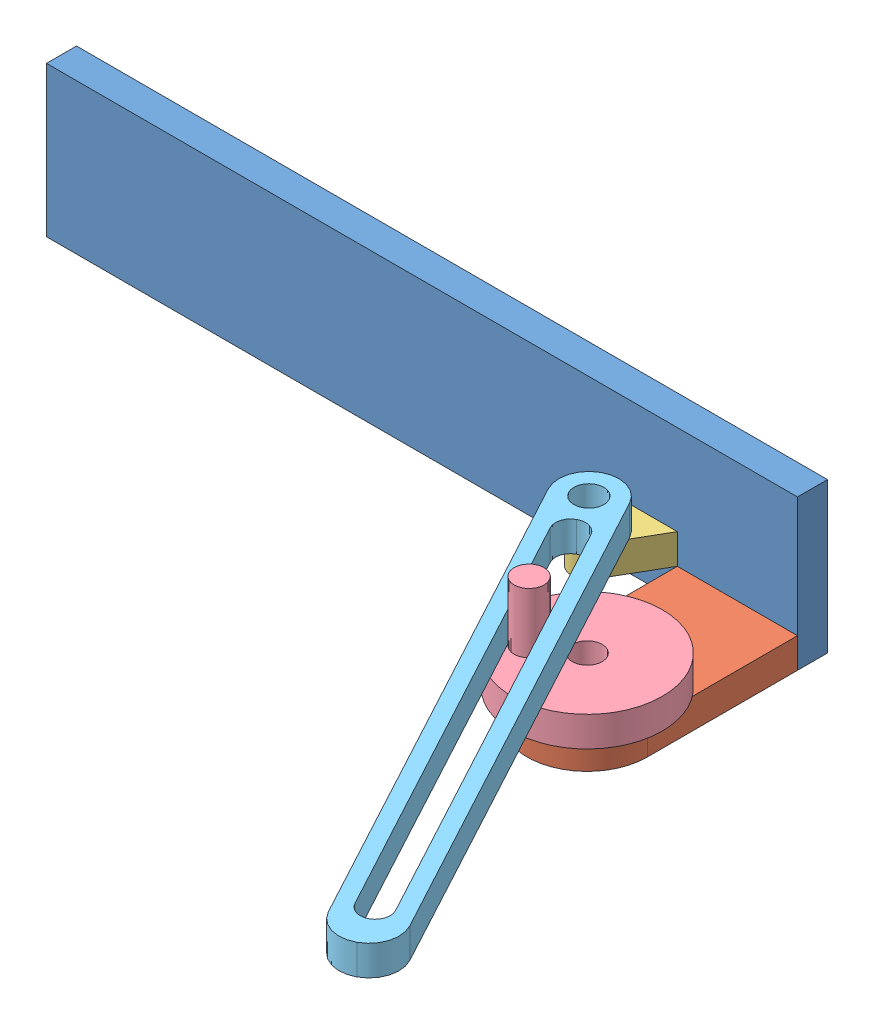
SolidWorks assembly linkage1.SLDASM, configuration Default (file format 6000). Lengths in mm.
Overall size (293.86 50 196.47).
5 component instances, 5 part files, 11 mates.
Components (placement in the parent):
- BASE-1: BASE.SLDPRT [Default] at (-20.7654 104.7281 181.6357) size (250 50 10)
- base1-1: base1.SLDPRT [Default] at (189.2346 114.7281 191.6357) x (1 0 0) z (0 -1 0) size (40 70 10)
- base2-1: base2.SLDPRT [Default] at (159.2346 124.7281 191.6357) x (1 0 0) z (0 -1 0) size (30 20.21 10)
- drive-1: drive.SLDPRT [Default] at (209.2346 114.7281 241.6357) x (-0.538478 0 -0.842639) z (0 1 0) size (50 50 30)
- slot-1: slot.SLDPRT [Default] at (178.3001 134.7281 192.5243) x (0.473984 0 0.880533) z (0 -1 0) size (200 20 10)
Mates (geometry in assembly coordinates):
- Coincident1: coincident anti-aligned: plane of BASE-1 through (-20.7654 104.7281 191.6357) normal (0 0 1); plane of base1-1 through (229.2346 104.7281 191.6357) normal (0 0 -1)
- Coincident2: coincident aligned: line of BASE-1 through (-20.7654 104.7281 191.6357) axis (1 0 0); line of base1-1 through (189.2346 104.7281 191.6357) axis (1 0 0)
- Coincident3: coincident aligned: line of BASE-1 through (229.2346 104.7281 191.6357) axis (0 1 0); line of base1-1 through (229.2346 104.7281 191.6357) axis (0 1 0)
- Coincident4: coincident anti-aligned: plane of BASE-1 through (-20.7654 104.7281 191.6357) normal (0 0 1); plane of base2-1 through (189.2346 114.7281 191.6357) normal (0 0 -1)
- Coincident5: coincident anti-aligned: plane of base1-1 through (209.2346 114.7281 241.6357) normal (0 1 0); plane of drive-1 through (209.2346 114.7281 241.6357) normal (0 -1 0)
- Concentric1: concentric anti-aligned: cylinder of base1-1 through (209.2346 114.7281 241.6357) axis (0 -1 0) radius 5; cylinder of drive-1 through (209.2346 114.7281 241.6357) axis (0 1 0) radius 5
- Coincident6: coincident anti-aligned: plane of drive-1 through (209.2346 124.7281 241.6357) normal (0 1 0); plane of slot-1 through (178.3001 124.7281 192.5243) normal (0 -1 0)
- Tangent2: tangent anti-aligned: cylinder of drive-1 through (197.4377 144.7281 249.1744) axis (0 -1 0) radius 5; plane of slot-1 through (174.5718 134.7281 217.2447) normal (0.880533 0 -0.473984)
- Coincident7: coincident anti-aligned: plane of base2-1 through (174.2346 124.7281 206.0695) normal (0 1 0); plane of slot-1 through (178.3001 124.7281 192.5243) normal (0 -1 0)
- Concentric2: concentric aligned: cylinder of base2-1 through (174.2346 124.7281 206.0695) axis (0 -1 0) radius 5; cylinder of slot-1 through (174.2346 134.7281 206.0695) axis (0 -1 0) radius 5
- Distance2: distance = 180 mm: line of base2-1 through (159.2346 114.7281 191.6357) axis (0 1 0); line of BASE-1 through (-20.7654 154.7281 191.6357) axis (0 -1 0)
